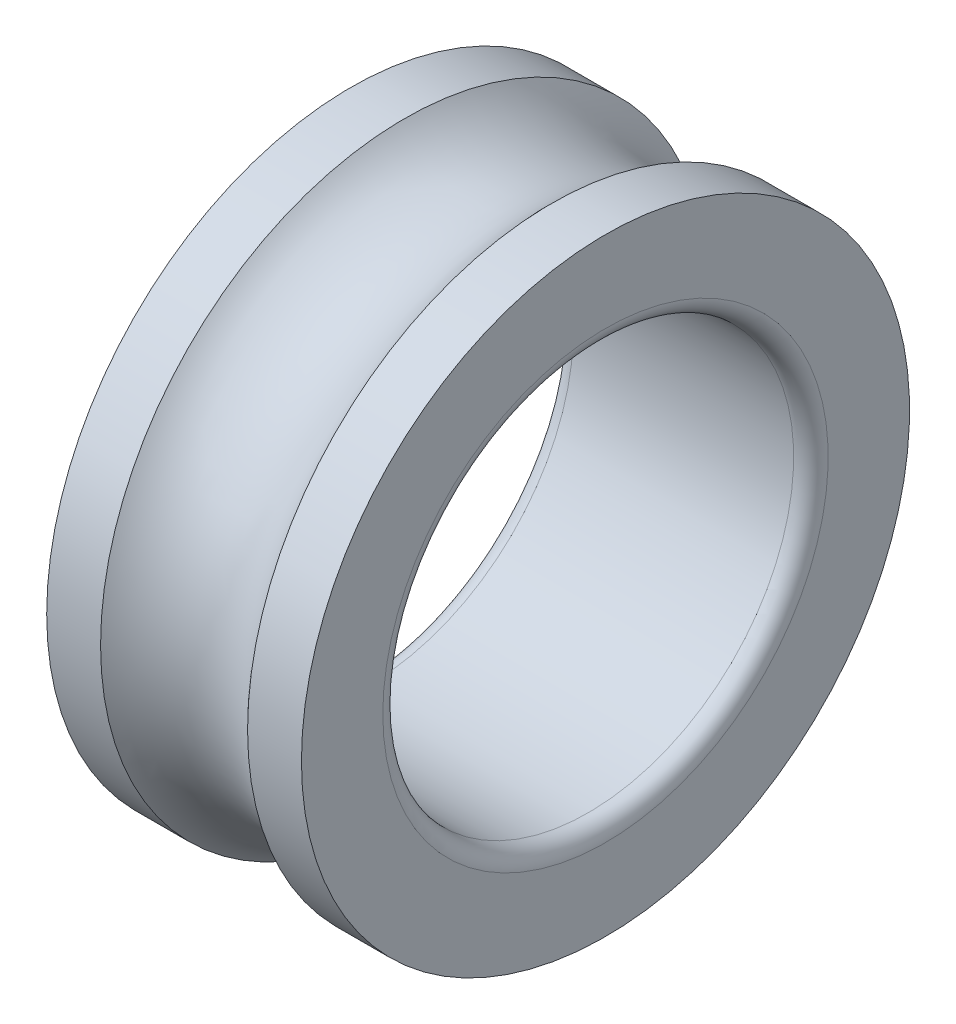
from build123d import *


with BuildPart() as part:
    # Sketch1 → Revolve1 (revolve)
    with BuildSketch(Plane.XY, mode=Mode.PRIVATE) as revolve1_sk:
        with BuildLine():
            Line((-15.5, 37), (-8.94427191, 37))
            ThreePointArc((-8.94427191, 37), (0, 33), (8.94427191, 37))
            Line((8.94427191, 37), (15.5, 37))
            Line((15.5, 37), (15.5, 27.1))
            ThreePointArc((15.5, 27.1), (14.88492424, 25.61507576), (13.4, 25))
            Line((13.4, 25), (-13.4, 25))
            ThreePointArc((-13.4, 25), (-14.88492424, 25.61507576), (-15.5, 27.1))
            Line((-15.5, 27.1), (-15.5, 37))
        make_face()
    revolve(revolve1_sk.sketch.rotate(Axis((-27.714673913, 0, 0), (1, 0, 0)), 90), axis=Axis((-27.714673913, 0, 0), (1, 0, 0)))


solid = part.part
